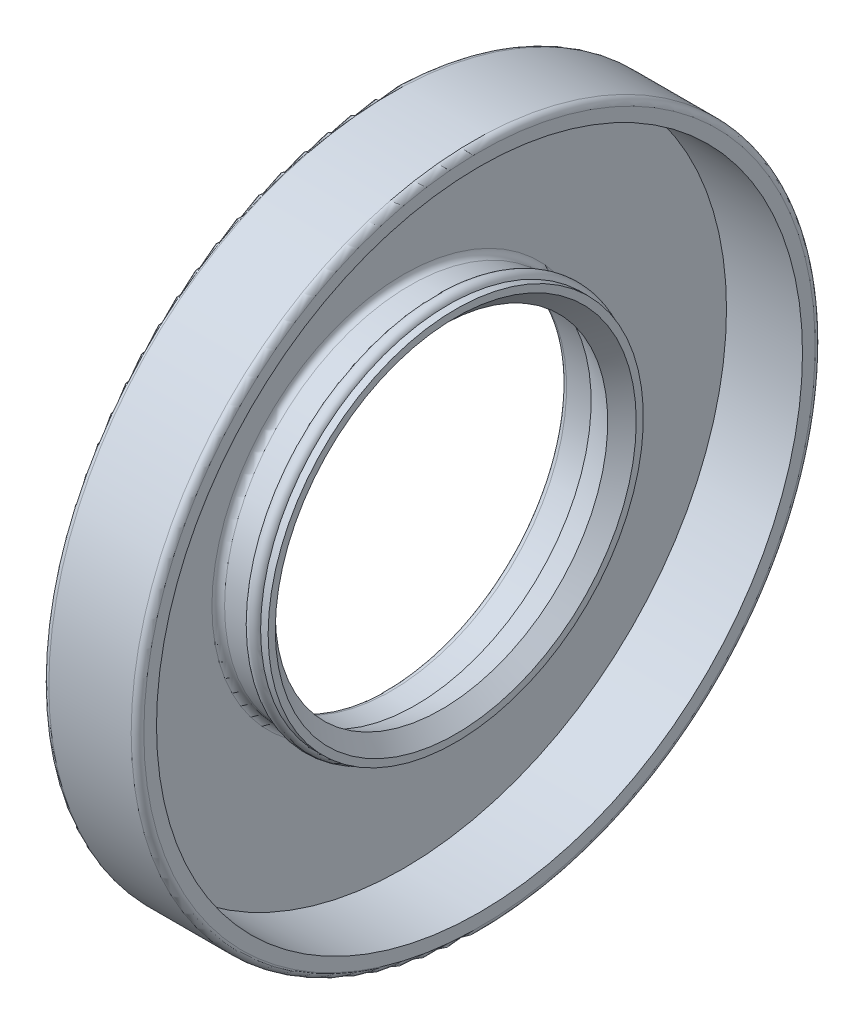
ISO-10303-21;
HEADER;
FILE_DESCRIPTION(('STEP AP214'),'2;1');
FILE_NAME('part.step','',(''),(''),'','','');
FILE_SCHEMA(('AUTOMOTIVE_DESIGN { 1 0 10303 214 1 1 1 1 }'));
ENDSEC;
DATA;
#1=APPLICATION_CONTEXT('core data for automotive mechanical design processes');
#2=APPLICATION_PROTOCOL_DEFINITION('international standard','automotive_design',2000,#1);
#3=PRODUCT_CONTEXT('',#1,'mechanical');
#4=PRODUCT('Part','Part','',(#3));
#5=PRODUCT_RELATED_PRODUCT_CATEGORY('part','',(#4));
#6=PRODUCT_DEFINITION_FORMATION('','',#4);
#7=PRODUCT_DEFINITION_CONTEXT('part definition',#1,'design');
#8=PRODUCT_DEFINITION('design','',#6,#7);
#9=PRODUCT_DEFINITION_SHAPE('','',#8);
#10=(LENGTH_UNIT() NAMED_UNIT(*) SI_UNIT(.MILLI.,.METRE.));
#11=(NAMED_UNIT(*) PLANE_ANGLE_UNIT() SI_UNIT($,.RADIAN.));
#12=(NAMED_UNIT(*) SI_UNIT($,.STERADIAN.) SOLID_ANGLE_UNIT());
#13=UNCERTAINTY_MEASURE_WITH_UNIT(LENGTH_MEASURE(1.E-05),#10,'distance_accuracy_value','');
#14=(GEOMETRIC_REPRESENTATION_CONTEXT(3) GLOBAL_UNCERTAINTY_ASSIGNED_CONTEXT((#13)) GLOBAL_UNIT_ASSIGNED_CONTEXT((#10,
#11,#12)) REPRESENTATION_CONTEXT('',''));
#15=CARTESIAN_POINT('',(0.,0.,0.));
#16=DIRECTION('',(0.,0.,1.));
#17=DIRECTION('',(1.,0.,0.));
#18=AXIS2_PLACEMENT_3D('',#15,#16,#17);
#19=CARTESIAN_POINT('',(2.,0.,-34.));
#20=DIRECTION('',(-1.,0.,0.));
#21=DIRECTION('',(0.,0.,1.));
#22=AXIS2_PLACEMENT_3D('',#19,#20,#21);
#23=PLANE('',#22);
#24=CARTESIAN_POINT('',(2.,0.,0.));
#25=DIRECTION('',(-1.,0.,0.));
#26=DIRECTION('',(0.,0.,1.));
#27=AXIS2_PLACEMENT_3D('',#24,#25,#26);
#28=CIRCLE('',#27,34.);
#29=CARTESIAN_POINT('',(2.,0.,34.));
#30=VERTEX_POINT('',#29);
#31=EDGE_CURVE('E84',#30,#30,#28,.T.);
#32=ORIENTED_EDGE('',*,*,#31,.F.);
#33=EDGE_LOOP('',(#32));
#34=FACE_BOUND('',#33,.T.);
#35=CARTESIAN_POINT('',(2.,0.,0.));
#36=DIRECTION('',(-1.,0.,0.));
#37=DIRECTION('',(0.,0.,1.));
#38=AXIS2_PLACEMENT_3D('',#35,#36,#37);
#39=CIRCLE('',#38,20.1666666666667);
#40=CARTESIAN_POINT('',(2.,0.,20.1666666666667));
#41=VERTEX_POINT('',#40);
#42=EDGE_CURVE('E10',#41,#41,#39,.T.);
#43=ORIENTED_EDGE('',*,*,#42,.T.);
#44=EDGE_LOOP('',(#43));
#45=FACE_BOUND('',#44,.T.);
#46=ADVANCED_FACE('F32',(#34,#45),#23,.F.);
#47=CARTESIAN_POINT('',(2.66666666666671,0.,0.));
#48=DIRECTION('',(-1.,0.,0.));
#49=DIRECTION('',(0.,0.,1.));
#50=AXIS2_PLACEMENT_3D('',#47,#48,#49);
#51=TOROIDAL_SURFACE('',#50,20.1666666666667,0.666666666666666);
#52=ORIENTED_EDGE('',*,*,#42,.F.);
#53=EDGE_LOOP('',(#52));
#54=FACE_BOUND('',#53,.T.);
#55=CARTESIAN_POINT('',(2.66666666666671,0.,0.));
#56=DIRECTION('',(-1.,0.,0.));
#57=DIRECTION('',(0.,0.,1.));
#58=AXIS2_PLACEMENT_3D('',#55,#56,#57);
#59=CIRCLE('',#58,19.5);
#60=CARTESIAN_POINT('',(2.66666666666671,0.,19.5));
#61=VERTEX_POINT('',#60);
#62=EDGE_CURVE('E38',#61,#61,#59,.T.);
#63=ORIENTED_EDGE('',*,*,#62,.T.);
#64=EDGE_LOOP('',(#63));
#65=FACE_BOUND('',#64,.T.);
#66=ADVANCED_FACE('F91',(#54,#65),#51,.F.);
#67=CARTESIAN_POINT('',(0.,0.,0.));
#68=DIRECTION('',(-1.,0.,0.));
#69=DIRECTION('',(0.,0.,1.));
#70=AXIS2_PLACEMENT_3D('',#67,#68,#69);
#71=CYLINDRICAL_SURFACE('',#70,19.5);
#72=ORIENTED_EDGE('',*,*,#62,.F.);
#73=EDGE_LOOP('',(#72));
#74=FACE_BOUND('',#73,.T.);
#75=CARTESIAN_POINT('',(5.24999999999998,0.,0.));
#76=DIRECTION('',(-1.,0.,0.));
#77=DIRECTION('',(0.,0.,1.));
#78=AXIS2_PLACEMENT_3D('',#75,#76,#77);
#79=CIRCLE('',#78,19.5);
#80=CARTESIAN_POINT('',(5.24999999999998,0.,19.5));
#81=VERTEX_POINT('',#80);
#82=EDGE_CURVE('E42',#81,#81,#79,.T.);
#83=ORIENTED_EDGE('',*,*,#82,.T.);
#84=EDGE_LOOP('',(#83));
#85=FACE_BOUND('',#84,.T.);
#86=ADVANCED_FACE('F95',(#74,#85),#71,.T.);
#87=CARTESIAN_POINT('',(6.00000000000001,0.,0.));
#88=DIRECTION('',(-1.,0.,0.));
#89=DIRECTION('',(0.,0.,1.));
#90=AXIS2_PLACEMENT_3D('',#87,#88,#89);
#91=TOROIDAL_SURFACE('',#90,19.5,0.75);
#92=ORIENTED_EDGE('',*,*,#82,.F.);
#93=EDGE_LOOP('',(#92));
#94=FACE_BOUND('',#93,.T.);
#95=CARTESIAN_POINT('',(6.70710678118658,0.,0.));
#96=DIRECTION('',(-1.,0.,0.));
#97=DIRECTION('',(0.,0.,1.));
#98=AXIS2_PLACEMENT_3D('',#95,#96,#97);
#99=CIRCLE('',#98,19.75);
#100=CARTESIAN_POINT('',(6.70710678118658,0.,19.75));
#101=VERTEX_POINT('',#100);
#102=EDGE_CURVE('E46',#101,#101,#99,.T.);
#103=ORIENTED_EDGE('',*,*,#102,.T.);
#104=EDGE_LOOP('',(#103));
#105=FACE_BOUND('',#104,.T.);
#106=ADVANCED_FACE('F100',(#94,#105),#91,.T.);
#107=CARTESIAN_POINT('',(0.,0.,0.));
#108=DIRECTION('',(-1.,0.,0.));
#109=DIRECTION('',(0.,0.,1.));
#110=AXIS2_PLACEMENT_3D('',#107,#108,#109);
#111=CYLINDRICAL_SURFACE('',#110,19.75);
#112=ORIENTED_EDGE('',*,*,#102,.F.);
#113=EDGE_LOOP('',(#112));
#114=FACE_BOUND('',#113,.T.);
#115=CARTESIAN_POINT('',(7.50000000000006,0.,0.));
#116=DIRECTION('',(-1.,0.,0.));
#117=DIRECTION('',(0.,0.,1.));
#118=AXIS2_PLACEMENT_3D('',#115,#116,#117);
#119=CIRCLE('',#118,19.75);
#120=CARTESIAN_POINT('',(7.50000000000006,0.,19.75));
#121=VERTEX_POINT('',#120);
#122=EDGE_CURVE('E51',#121,#121,#119,.T.);
#123=ORIENTED_EDGE('',*,*,#122,.T.);
#124=EDGE_LOOP('',(#123));
#125=FACE_BOUND('',#124,.T.);
#126=ADVANCED_FACE('F106',(#114,#125),#111,.T.);
#127=CARTESIAN_POINT('',(7.50000000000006,0.,-19.));
#128=DIRECTION('',(-1.,0.,0.));
#129=DIRECTION('',(0.,0.,1.));
#130=AXIS2_PLACEMENT_3D('',#127,#128,#129);
#131=PLANE('',#130);
#132=ORIENTED_EDGE('',*,*,#122,.F.);
#133=EDGE_LOOP('',(#132));
#134=FACE_BOUND('',#133,.T.);
#135=CARTESIAN_POINT('',(7.50000000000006,0.,0.));
#136=DIRECTION('',(-1.,0.,0.));
#137=DIRECTION('',(0.,0.,1.));
#138=AXIS2_PLACEMENT_3D('',#135,#136,#137);
#139=CIRCLE('',#138,19.);
#140=CARTESIAN_POINT('',(7.50000000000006,0.,19.));
#141=VERTEX_POINT('',#140);
#142=EDGE_CURVE('E54',#141,#141,#139,.T.);
#143=ORIENTED_EDGE('',*,*,#142,.T.);
#144=EDGE_LOOP('',(#143));
#145=FACE_BOUND('',#144,.T.);
#146=ADVANCED_FACE('F110',(#134,#145),#131,.F.);
#147=CARTESIAN_POINT('',(6.00000000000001,0.,0.));
#148=DIRECTION('',(1.,0.,0.));
#149=DIRECTION('',(0.,0.,-1.));
#150=AXIS2_PLACEMENT_3D('',#147,#148,#149);
#151=CONICAL_SURFACE('',#150,17.5,0.78539816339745);
#152=ORIENTED_EDGE('',*,*,#142,.F.);
#153=EDGE_LOOP('',(#152));
#154=FACE_BOUND('',#153,.T.);
#155=CARTESIAN_POINT('',(6.00000000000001,0.,0.));
#156=DIRECTION('',(-1.,0.,0.));
#157=DIRECTION('',(0.,0.,1.));
#158=AXIS2_PLACEMENT_3D('',#155,#156,#157);
#159=CIRCLE('',#158,17.5);
#160=CARTESIAN_POINT('',(6.00000000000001,0.,17.5));
#161=VERTEX_POINT('',#160);
#162=EDGE_CURVE('E57',#161,#161,#159,.T.);
#163=ORIENTED_EDGE('',*,*,#162,.T.);
#164=EDGE_LOOP('',(#163));
#165=FACE_BOUND('',#164,.T.);
#166=ADVANCED_FACE('F114',(#154,#165),#151,.F.);
#167=CARTESIAN_POINT('',(3.25252258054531,0.,0.));
#168=DIRECTION('',(-1.,0.,0.));
#169=DIRECTION('',(0.,0.,1.));
#170=AXIS2_PLACEMENT_3D('',#167,#168,#169);
#171=CONICAL_SURFACE('',#170,18.5,0.349065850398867);
#172=ORIENTED_EDGE('',*,*,#162,.F.);
#173=EDGE_LOOP('',(#172));
#174=FACE_BOUND('',#173,.T.);
#175=CARTESIAN_POINT('',(3.25252258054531,0.,0.));
#176=DIRECTION('',(-1.,0.,0.));
#177=DIRECTION('',(0.,0.,1.));
#178=AXIS2_PLACEMENT_3D('',#175,#176,#177);
#179=CIRCLE('',#178,18.5);
#180=CARTESIAN_POINT('',(3.25252258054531,0.,18.5));
#181=VERTEX_POINT('',#180);
#182=EDGE_CURVE('E60',#181,#181,#179,.T.);
#183=ORIENTED_EDGE('',*,*,#182,.T.);
#184=EDGE_LOOP('',(#183));
#185=FACE_BOUND('',#184,.T.);
#186=ADVANCED_FACE('F118',(#174,#185),#171,.F.);
#187=CARTESIAN_POINT('',(0.,0.,0.));
#188=DIRECTION('',(-1.,0.,0.));
#189=DIRECTION('',(0.,0.,1.));
#190=AXIS2_PLACEMENT_3D('',#187,#188,#189);
#191=CYLINDRICAL_SURFACE('',#190,18.5);
#192=ORIENTED_EDGE('',*,*,#182,.F.);
#193=EDGE_LOOP('',(#192));
#194=FACE_BOUND('',#193,.T.);
#195=CARTESIAN_POINT('',(0.666666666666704,0.,0.));
#196=DIRECTION('',(-1.,0.,0.));
#197=DIRECTION('',(0.,0.,1.));
#198=AXIS2_PLACEMENT_3D('',#195,#196,#197);
#199=CIRCLE('',#198,18.5);
#200=CARTESIAN_POINT('',(0.666666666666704,0.,18.5));
#201=VERTEX_POINT('',#200);
#202=EDGE_CURVE('E63',#201,#201,#199,.T.);
#203=ORIENTED_EDGE('',*,*,#202,.T.);
#204=EDGE_LOOP('',(#203));
#205=FACE_BOUND('',#204,.T.);
#206=ADVANCED_FACE('F122',(#194,#205),#191,.F.);
#207=CARTESIAN_POINT('',(0.666666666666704,0.,0.));
#208=DIRECTION('',(-1.,0.,0.));
#209=DIRECTION('',(0.,0.,1.));
#210=AXIS2_PLACEMENT_3D('',#207,#208,#209);
#211=TOROIDAL_SURFACE('',#210,19.1666666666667,0.666666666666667);
#212=ORIENTED_EDGE('',*,*,#202,.F.);
#213=EDGE_LOOP('',(#212));
#214=FACE_BOUND('',#213,.T.);
#215=CARTESIAN_POINT('',(0.,0.,0.));
#216=DIRECTION('',(-1.,0.,0.));
#217=DIRECTION('',(0.,0.,1.));
#218=AXIS2_PLACEMENT_3D('',#215,#216,#217);
#219=CIRCLE('',#218,19.1666666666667);
#220=CARTESIAN_POINT('',(0.,0.,19.1666666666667));
#221=VERTEX_POINT('',#220);
#222=EDGE_CURVE('E66',#221,#221,#219,.T.);
#223=ORIENTED_EDGE('',*,*,#222,.T.);
#224=EDGE_LOOP('',(#223));
#225=FACE_BOUND('',#224,.T.);
#226=ADVANCED_FACE('F126',(#214,#225),#211,.T.);
#227=CARTESIAN_POINT('',(0.,0.,-19.1666666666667));
#228=DIRECTION('',(1.,0.,0.));
#229=DIRECTION('',(0.,0.,-1.));
#230=AXIS2_PLACEMENT_3D('',#227,#228,#229);
#231=PLANE('',#230);
#232=ORIENTED_EDGE('',*,*,#222,.F.);
#233=EDGE_LOOP('',(#232));
#234=FACE_BOUND('',#233,.T.);
#235=CARTESIAN_POINT('',(0.,0.,0.));
#236=DIRECTION('',(-1.,0.,0.));
#237=DIRECTION('',(0.,0.,1.));
#238=AXIS2_PLACEMENT_3D('',#235,#236,#237);
#239=CIRCLE('',#238,35.3333333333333);
#240=CARTESIAN_POINT('',(0.,0.,35.3333333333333));
#241=VERTEX_POINT('',#240);
#242=EDGE_CURVE('E69',#241,#241,#239,.T.);
#243=ORIENTED_EDGE('',*,*,#242,.T.);
#244=EDGE_LOOP('',(#243));
#245=FACE_BOUND('',#244,.T.);
#246=ADVANCED_FACE('F130',(#234,#245),#231,.F.);
#247=CARTESIAN_POINT('',(0.666666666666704,0.,0.));
#248=DIRECTION('',(-1.,0.,0.));
#249=DIRECTION('',(0.,0.,1.));
#250=AXIS2_PLACEMENT_3D('',#247,#248,#249);
#251=TOROIDAL_SURFACE('',#250,35.3333333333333,0.666666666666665);
#252=ORIENTED_EDGE('',*,*,#242,.F.);
#253=EDGE_LOOP('',(#252));
#254=FACE_BOUND('',#253,.T.);
#255=CARTESIAN_POINT('',(0.666666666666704,0.,0.));
#256=DIRECTION('',(-1.,0.,0.));
#257=DIRECTION('',(0.,0.,1.));
#258=AXIS2_PLACEMENT_3D('',#255,#256,#257);
#259=CIRCLE('',#258,36.);
#260=CARTESIAN_POINT('',(0.666666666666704,0.,36.));
#261=VERTEX_POINT('',#260);
#262=EDGE_CURVE('E72',#261,#261,#259,.T.);
#263=ORIENTED_EDGE('',*,*,#262,.T.);
#264=EDGE_LOOP('',(#263));
#265=FACE_BOUND('',#264,.T.);
#266=ADVANCED_FACE('F134',(#254,#265),#251,.T.);
#267=CARTESIAN_POINT('',(0.,0.,0.));
#268=DIRECTION('',(-1.,0.,0.));
#269=DIRECTION('',(0.,0.,1.));
#270=AXIS2_PLACEMENT_3D('',#267,#268,#269);
#271=CYLINDRICAL_SURFACE('',#270,36.);
#272=ORIENTED_EDGE('',*,*,#262,.F.);
#273=EDGE_LOOP('',(#272));
#274=FACE_BOUND('',#273,.T.);
#275=CARTESIAN_POINT('',(9.3333333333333,0.,0.));
#276=DIRECTION('',(-1.,0.,0.));
#277=DIRECTION('',(0.,0.,1.));
#278=AXIS2_PLACEMENT_3D('',#275,#276,#277);
#279=CIRCLE('',#278,36.);
#280=CARTESIAN_POINT('',(9.3333333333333,0.,36.));
#281=VERTEX_POINT('',#280);
#282=EDGE_CURVE('E75',#281,#281,#279,.T.);
#283=ORIENTED_EDGE('',*,*,#282,.T.);
#284=EDGE_LOOP('',(#283));
#285=FACE_BOUND('',#284,.T.);
#286=ADVANCED_FACE('F138',(#274,#285),#271,.T.);
#287=CARTESIAN_POINT('',(9.3333333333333,0.,0.));
#288=DIRECTION('',(-1.,0.,0.));
#289=DIRECTION('',(0.,0.,1.));
#290=AXIS2_PLACEMENT_3D('',#287,#288,#289);
#291=TOROIDAL_SURFACE('',#290,35.3333333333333,0.666666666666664);
#292=ORIENTED_EDGE('',*,*,#282,.F.);
#293=EDGE_LOOP('',(#292));
#294=FACE_BOUND('',#293,.T.);
#295=CARTESIAN_POINT('',(10.,0.,0.));
#296=DIRECTION('',(-1.,0.,0.));
#297=DIRECTION('',(0.,0.,1.));
#298=AXIS2_PLACEMENT_3D('',#295,#296,#297);
#299=CIRCLE('',#298,35.3333333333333);
#300=CARTESIAN_POINT('',(10.,0.,35.3333333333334));
#301=VERTEX_POINT('',#300);
#302=EDGE_CURVE('E78',#301,#301,#299,.T.);
#303=ORIENTED_EDGE('',*,*,#302,.T.);
#304=EDGE_LOOP('',(#303));
#305=FACE_BOUND('',#304,.T.);
#306=ADVANCED_FACE('F142',(#294,#305),#291,.T.);
#307=CARTESIAN_POINT('',(10.,0.,-34.));
#308=DIRECTION('',(-1.,0.,0.));
#309=DIRECTION('',(0.,0.,1.));
#310=AXIS2_PLACEMENT_3D('',#307,#308,#309);
#311=PLANE('',#310);
#312=ORIENTED_EDGE('',*,*,#302,.F.);
#313=EDGE_LOOP('',(#312));
#314=FACE_BOUND('',#313,.T.);
#315=CARTESIAN_POINT('',(10.,0.,0.));
#316=DIRECTION('',(-1.,0.,0.));
#317=DIRECTION('',(0.,0.,1.));
#318=AXIS2_PLACEMENT_3D('',#315,#316,#317);
#319=CIRCLE('',#318,34.);
#320=CARTESIAN_POINT('',(10.,0.,34.));
#321=VERTEX_POINT('',#320);
#322=EDGE_CURVE('E81',#321,#321,#319,.T.);
#323=ORIENTED_EDGE('',*,*,#322,.T.);
#324=EDGE_LOOP('',(#323));
#325=FACE_BOUND('',#324,.T.);
#326=ADVANCED_FACE('F146',(#314,#325),#311,.F.);
#327=CARTESIAN_POINT('',(0.,0.,0.));
#328=DIRECTION('',(-1.,0.,0.));
#329=DIRECTION('',(0.,0.,1.));
#330=AXIS2_PLACEMENT_3D('',#327,#328,#329);
#331=CYLINDRICAL_SURFACE('',#330,34.);
#332=ORIENTED_EDGE('',*,*,#322,.F.);
#333=EDGE_LOOP('',(#332));
#334=FACE_BOUND('',#333,.T.);
#335=ORIENTED_EDGE('',*,*,#31,.T.);
#336=EDGE_LOOP('',(#335));
#337=FACE_BOUND('',#336,.T.);
#338=ADVANCED_FACE('F88',(#334,#337),#331,.F.);
#339=CLOSED_SHELL('',(#46,#66,#86,#106,#126,#146,#166,#186,#206,#226,#246,#266,#286,#306,#326,#338));
#340=MANIFOLD_SOLID_BREP('B2',#339);
#341=ADVANCED_BREP_SHAPE_REPRESENTATION('',(#18,#340),#14);
#342=SHAPE_DEFINITION_REPRESENTATION(#9,#341);
ENDSEC;
END-ISO-10303-21;
